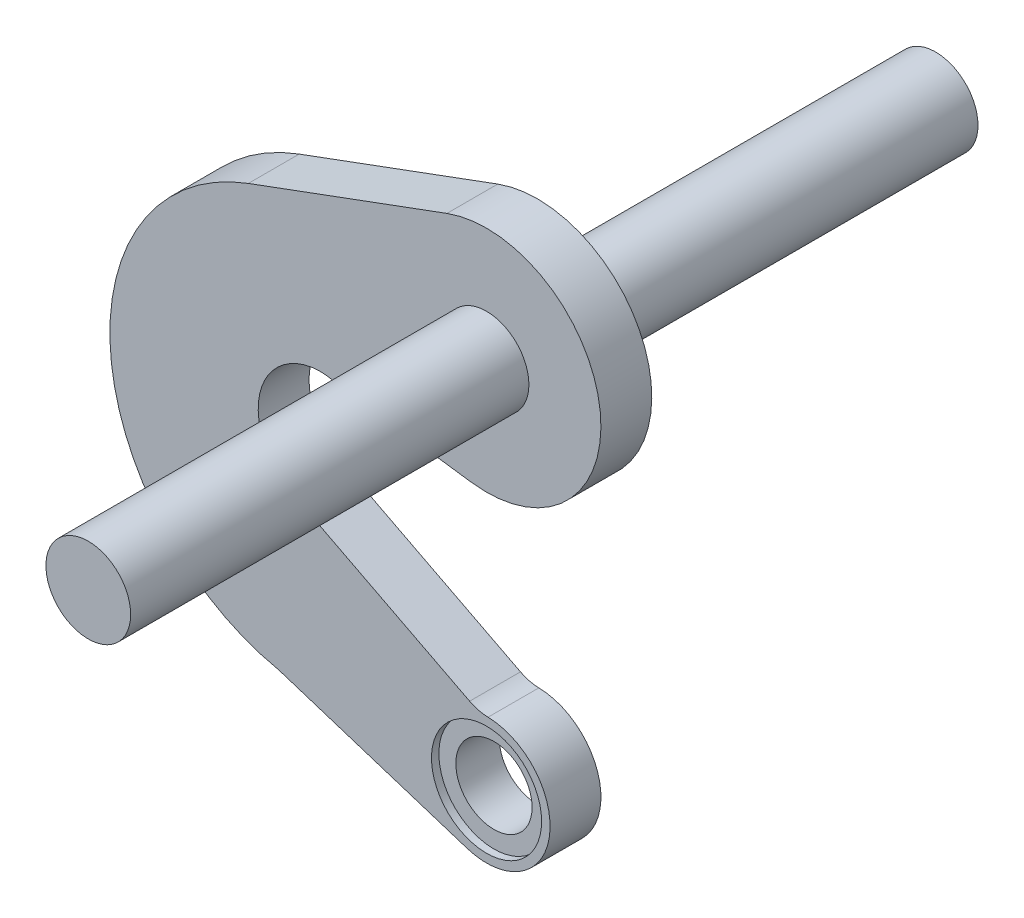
ISO-10303-21;
HEADER;
FILE_DESCRIPTION(('STEP AP214'),'2;1');
FILE_NAME('part.step','',(''),(''),'','','');
FILE_SCHEMA(('AUTOMOTIVE_DESIGN { 1 0 10303 214 1 1 1 1 }'));
ENDSEC;
DATA;
#1=APPLICATION_CONTEXT('core data for automotive mechanical design processes');
#2=APPLICATION_PROTOCOL_DEFINITION('international standard','automotive_design',2000,#1);
#3=PRODUCT_CONTEXT('',#1,'mechanical');
#4=PRODUCT('Part','Part','',(#3));
#5=PRODUCT_RELATED_PRODUCT_CATEGORY('part','',(#4));
#6=PRODUCT_DEFINITION_FORMATION('','',#4);
#7=PRODUCT_DEFINITION_CONTEXT('part definition',#1,'design');
#8=PRODUCT_DEFINITION('design','',#6,#7);
#9=PRODUCT_DEFINITION_SHAPE('','',#8);
#10=(LENGTH_UNIT() NAMED_UNIT(*) SI_UNIT(.MILLI.,.METRE.));
#11=(NAMED_UNIT(*) PLANE_ANGLE_UNIT() SI_UNIT($,.RADIAN.));
#12=(NAMED_UNIT(*) SI_UNIT($,.STERADIAN.) SOLID_ANGLE_UNIT());
#13=UNCERTAINTY_MEASURE_WITH_UNIT(LENGTH_MEASURE(1.E-05),#10,'distance_accuracy_value','');
#14=(GEOMETRIC_REPRESENTATION_CONTEXT(3) GLOBAL_UNCERTAINTY_ASSIGNED_CONTEXT((#13)) GLOBAL_UNIT_ASSIGNED_CONTEXT((#10,
#11,#12)) REPRESENTATION_CONTEXT('',''));
#15=CARTESIAN_POINT('',(0.,0.,0.));
#16=DIRECTION('',(0.,0.,1.));
#17=DIRECTION('',(1.,0.,0.));
#18=AXIS2_PLACEMENT_3D('',#15,#16,#17);
#19=CARTESIAN_POINT('',(0.,-87.8,-6.));
#20=DIRECTION('',(0.,0.,1.));
#21=DIRECTION('',(1.,0.,0.));
#22=AXIS2_PLACEMENT_3D('',#19,#20,#21);
#23=CYLINDRICAL_SURFACE('',#22,15.);
#24=CARTESIAN_POINT('',(0.,-87.8,6.));
#25=DIRECTION('',(0.,0.,1.));
#26=DIRECTION('',(1.,0.,0.));
#27=AXIS2_PLACEMENT_3D('',#24,#25,#26);
#28=CIRCLE('',#27,15.);
#29=CARTESIAN_POINT('',(-4.57525038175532,-102.08520507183,6.));
#30=VERTEX_POINT('',#29);
#31=CARTESIAN_POINT('',(0.34996282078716,-72.8040830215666,6.));
#32=VERTEX_POINT('',#31);
#33=EDGE_CURVE('E189',#30,#32,#28,.T.);
#34=ORIENTED_EDGE('',*,*,#33,.F.);
#35=DIRECTION('',(0.,0.,1.));
#36=VECTOR('',#35,1.);
#37=CARTESIAN_POINT('',(-4.57525038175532,-102.08520507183,-52.7038542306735));
#38=LINE('',#37,#36);
#39=CARTESIAN_POINT('',(-4.57525038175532,-102.08520507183,-6.));
#40=VERTEX_POINT('',#39);
#41=EDGE_CURVE('E139',#40,#30,#38,.T.);
#42=ORIENTED_EDGE('',*,*,#41,.F.);
#43=CARTESIAN_POINT('',(0.,-87.8,-6.));
#44=DIRECTION('',(0.,0.,1.));
#45=DIRECTION('',(1.,0.,0.));
#46=AXIS2_PLACEMENT_3D('',#43,#44,#45);
#47=CIRCLE('',#46,15.);
#48=CARTESIAN_POINT('',(0.34996282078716,-72.8040830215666,-6.));
#49=VERTEX_POINT('',#48);
#50=EDGE_CURVE('E195',#40,#49,#47,.T.);
#51=ORIENTED_EDGE('',*,*,#50,.T.);
#52=DIRECTION('',(0.,0.,-1.));
#53=VECTOR('',#52,1.);
#54=CARTESIAN_POINT('',(0.34996282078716,-72.8040830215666,6.));
#55=LINE('',#54,#53);
#56=EDGE_CURVE('E177',#32,#49,#55,.T.);
#57=ORIENTED_EDGE('',*,*,#56,.F.);
#58=EDGE_LOOP('',(#34,#42,#51,#57));
#59=FACE_BOUND('',#58,.T.);
#60=ADVANCED_FACE('F37',(#59),#23,.T.);
#61=CARTESIAN_POINT('',(0.,0.,-6.));
#62=DIRECTION('',(0.,0.,1.));
#63=DIRECTION('',(1.,0.,0.));
#64=AXIS2_PLACEMENT_3D('',#61,#62,#63);
#65=CYLINDRICAL_SURFACE('',#64,27.);
#66=DIRECTION('',(0.,0.,-1.));
#67=VECTOR('',#66,1.);
#68=CARTESIAN_POINT('',(-9.35237988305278,25.328501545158,55.9599839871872));
#69=LINE('',#68,#67);
#70=CARTESIAN_POINT('',(-9.35237988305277,25.328501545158,6.));
#71=VERTEX_POINT('',#70);
#72=CARTESIAN_POINT('',(-9.35237988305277,25.328501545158,-6.));
#73=VERTEX_POINT('',#72);
#74=EDGE_CURVE('E56',#71,#73,#69,.T.);
#75=ORIENTED_EDGE('',*,*,#74,.F.);
#76=CARTESIAN_POINT('',(0.,0.,6.));
#77=DIRECTION('',(0.,0.,1.));
#78=DIRECTION('',(1.,0.,0.));
#79=AXIS2_PLACEMENT_3D('',#76,#77,#78);
#80=CIRCLE('',#79,27.);
#81=CARTESIAN_POINT('',(-3.70089995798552,-26.7451554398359,6.));
#82=VERTEX_POINT('',#81);
#83=EDGE_CURVE('E130',#82,#71,#80,.T.);
#84=ORIENTED_EDGE('',*,*,#83,.F.);
#85=DIRECTION('',(0.,0.,1.));
#86=VECTOR('',#85,1.);
#87=CARTESIAN_POINT('',(-3.70089995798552,-26.7451554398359,-52.7038542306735));
#88=LINE('',#87,#86);
#89=CARTESIAN_POINT('',(-3.70089995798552,-26.7451554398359,-6.));
#90=VERTEX_POINT('',#89);
#91=EDGE_CURVE('E151',#90,#82,#88,.T.);
#92=ORIENTED_EDGE('',*,*,#91,.F.);
#93=CARTESIAN_POINT('',(0.,0.,-6.));
#94=DIRECTION('',(0.,0.,1.));
#95=DIRECTION('',(1.,0.,0.));
#96=AXIS2_PLACEMENT_3D('',#93,#94,#95);
#97=CIRCLE('',#96,27.);
#98=EDGE_CURVE('E52',#90,#73,#97,.T.);
#99=ORIENTED_EDGE('',*,*,#98,.T.);
#100=EDGE_LOOP('',(#75,#84,#92,#99));
#101=FACE_BOUND('',#100,.T.);
#102=ADVANCED_FACE('F222',(#101),#65,.T.);
#103=CARTESIAN_POINT('',(0.,-87.8,-6.));
#104=DIRECTION('',(0.,0.,1.));
#105=DIRECTION('',(1.,0.,0.));
#106=AXIS2_PLACEMENT_3D('',#103,#104,#105);
#107=CYLINDRICAL_SURFACE('',#106,9.);
#108=CARTESIAN_POINT('',(0.,-87.8,-6.));
#109=DIRECTION('',(0.,0.,1.));
#110=DIRECTION('',(1.,0.,0.));
#111=AXIS2_PLACEMENT_3D('',#108,#109,#110);
#112=CIRCLE('',#111,9.);
#113=CARTESIAN_POINT('',(9.,-87.8,-6.));
#114=VERTEX_POINT('',#113);
#115=EDGE_CURVE('E192',#114,#114,#112,.T.);
#116=ORIENTED_EDGE('',*,*,#115,.F.);
#117=EDGE_LOOP('',(#116));
#118=FACE_BOUND('',#117,.T.);
#119=CARTESIAN_POINT('',(0.,-87.8,4.25));
#120=DIRECTION('',(0.,0.,1.));
#121=DIRECTION('',(1.,0.,0.));
#122=AXIS2_PLACEMENT_3D('',#119,#120,#121);
#123=CIRCLE('',#122,9.);
#124=CARTESIAN_POINT('',(9.,-87.8,4.25));
#125=VERTEX_POINT('',#124);
#126=EDGE_CURVE('E158',#125,#125,#123,.F.);
#127=ORIENTED_EDGE('',*,*,#126,.F.);
#128=EDGE_LOOP('',(#127));
#129=FACE_BOUND('',#128,.T.);
#130=ADVANCED_FACE('F256',(#118,#129),#107,.F.);
#131=CARTESIAN_POINT('',(0.,-87.8,-6.));
#132=DIRECTION('',(0.,0.,1.));
#133=DIRECTION('',(1.,0.,0.));
#134=AXIS2_PLACEMENT_3D('',#131,#132,#133);
#135=PLANE('',#134);
#136=DIRECTION('',(0.938092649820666,0.346384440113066,0.));
#137=VECTOR('',#136,1.);
#138=CARTESIAN_POINT('',(-9.35237988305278,25.328501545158,-6.));
#139=LINE('',#138,#137);
#140=CARTESIAN_POINT('',(-56.2194736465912,8.02314046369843,-6.));
#141=VERTEX_POINT('',#140);
#142=EDGE_CURVE('E132',#141,#73,#139,.T.);
#143=ORIENTED_EDGE('',*,*,#142,.T.);
#144=ORIENTED_EDGE('',*,*,#98,.F.);
#145=DIRECTION('',(-0.990561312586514,0.137070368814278,0.));
#146=VECTOR('',#145,1.);
#147=CARTESIAN_POINT('',(-3.70089995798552,-26.7451554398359,-6.));
#148=LINE('',#147,#146);
#149=CARTESIAN_POINT('',(-37.7392676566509,-22.0350465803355,-6.));
#150=VERTEX_POINT('',#149);
#151=EDGE_CURVE('E147',#90,#150,#148,.T.);
#152=ORIENTED_EDGE('',*,*,#151,.T.);
#153=CARTESIAN_POINT('',(-39.3841120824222,-33.9217823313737,-6.));
#154=DIRECTION('',(0.,0.,1.));
#155=DIRECTION('',(1.,0.,0.));
#156=AXIS2_PLACEMENT_3D('',#153,#154,#155);
#157=CIRCLE('',#156,12.);
#158=CARTESIAN_POINT('',(-41.3439627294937,-22.0829063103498,-6.));
#159=VERTEX_POINT('',#158);
#160=EDGE_CURVE('E45',#150,#159,#157,.T.);
#161=ORIENTED_EDGE('',*,*,#160,.T.);
#162=CARTESIAN_POINT('',(-38.8941494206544,-36.8815013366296,-6.));
#163=DIRECTION('',(0.,0.,1.));
#164=DIRECTION('',(1.,0.,0.));
#165=AXIS2_PLACEMENT_3D('',#162,#163,#164);
#166=CIRCLE('',#165,15.);
#167=CARTESIAN_POINT('',(-45.754408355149,-50.2207984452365,-6.));
#168=VERTEX_POINT('',#167);
#169=EDGE_CURVE('E170',#159,#168,#166,.T.);
#170=ORIENTED_EDGE('',*,*,#169,.T.);
#171=DIRECTION('',(0.889286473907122,-0.457350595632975,0.));
#172=VECTOR('',#171,1.);
#173=CARTESIAN_POINT('',(-3.99023458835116,-71.6996697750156,-6.));
#174=LINE('',#173,#172);
#175=CARTESIAN_POINT('',(-3.99023458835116,-71.6996697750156,-6.));
#176=VERTEX_POINT('',#175);
#177=EDGE_CURVE('E172',#168,#176,#174,.T.);
#178=ORIENTED_EDGE('',*,*,#177,.T.);
#179=CARTESIAN_POINT('',(0.583271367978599,-62.8068050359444,-6.));
#180=DIRECTION('',(0.,0.,1.));
#181=DIRECTION('',(-1.,0.,0.));
#182=AXIS2_PLACEMENT_3D('',#179,#180,#181);
#183=CIRCLE('',#182,10.);
#184=EDGE_CURVE('E124',#176,#49,#183,.T.);
#185=ORIENTED_EDGE('',*,*,#184,.T.);
#186=ORIENTED_EDGE('',*,*,#50,.F.);
#187=DIRECTION('',(-0.952347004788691,0.305016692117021,0.));
#188=VECTOR('',#187,1.);
#189=CARTESIAN_POINT('',(-4.57525038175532,-102.08520507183,-6.));
#190=LINE('',#189,#188);
#191=CARTESIAN_POINT('',(-49.0535260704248,-87.8397499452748,-6.));
#192=VERTEX_POINT('',#191);
#193=EDGE_CURVE('E143',#40,#192,#190,.T.);
#194=ORIENTED_EDGE('',*,*,#193,.T.);
#195=CARTESIAN_POINT('',(-38.900251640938,-38.8814920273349,-6.));
#196=DIRECTION('',(0.,0.,-1.));
#197=DIRECTION('',(-1.,0.,0.));
#198=AXIS2_PLACEMENT_3D('',#195,#196,#197);
#199=CIRCLE('',#198,50.);
#200=EDGE_CURVE('E168',#192,#141,#199,.T.);
#201=ORIENTED_EDGE('',*,*,#200,.T.);
#202=EDGE_LOOP('',(#143,#144,#152,#161,#170,#178,#185,#186,#194,#201));
#203=FACE_BOUND('',#202,.T.);
#204=CARTESIAN_POINT('',(0.,0.,-6.00000000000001));
#205=DIRECTION('',(0.,0.,1.));
#206=DIRECTION('',(1.,0.,0.));
#207=AXIS2_PLACEMENT_3D('',#204,#205,#206);
#208=CIRCLE('',#207,10.);
#209=CARTESIAN_POINT('',(10.,0.,-6.00000000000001));
#210=VERTEX_POINT('',#209);
#211=EDGE_CURVE('E223',#210,#210,#208,.T.);
#212=ORIENTED_EDGE('',*,*,#211,.T.);
#213=EDGE_LOOP('',(#212));
#214=FACE_BOUND('',#213,.T.);
#215=ORIENTED_EDGE('',*,*,#115,.T.);
#216=EDGE_LOOP('',(#215));
#217=FACE_BOUND('',#216,.T.);
#218=ADVANCED_FACE('F206',(#203,#214,#217),#135,.F.);
#219=CARTESIAN_POINT('',(0.,-87.8,6.));
#220=DIRECTION('',(0.,0.,1.));
#221=DIRECTION('',(1.,0.,0.));
#222=AXIS2_PLACEMENT_3D('',#219,#220,#221);
#223=PLANE('',#222);
#224=ORIENTED_EDGE('',*,*,#83,.T.);
#225=DIRECTION('',(0.938092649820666,0.346384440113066,0.));
#226=VECTOR('',#225,1.);
#227=CARTESIAN_POINT('',(-9.35237988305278,25.328501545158,6.));
#228=LINE('',#227,#226);
#229=CARTESIAN_POINT('',(-56.2194736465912,8.02314046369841,6.));
#230=VERTEX_POINT('',#229);
#231=EDGE_CURVE('E127',#230,#71,#228,.T.);
#232=ORIENTED_EDGE('',*,*,#231,.F.);
#233=CARTESIAN_POINT('',(-38.900251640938,-38.8814920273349,6.));
#234=DIRECTION('',(0.,0.,-1.));
#235=DIRECTION('',(-1.,0.,0.));
#236=AXIS2_PLACEMENT_3D('',#233,#234,#235);
#237=CIRCLE('',#236,50.);
#238=CARTESIAN_POINT('',(-49.0535260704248,-87.8397499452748,6.));
#239=VERTEX_POINT('',#238);
#240=EDGE_CURVE('E112',#239,#230,#237,.T.);
#241=ORIENTED_EDGE('',*,*,#240,.F.);
#242=DIRECTION('',(0.952347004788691,-0.305016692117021,0.));
#243=VECTOR('',#242,1.);
#244=CARTESIAN_POINT('',(-4.57525038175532,-102.08520507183,6.));
#245=LINE('',#244,#243);
#246=EDGE_CURVE('E137',#239,#30,#245,.T.);
#247=ORIENTED_EDGE('',*,*,#246,.T.);
#248=ORIENTED_EDGE('',*,*,#33,.T.);
#249=CARTESIAN_POINT('',(0.583271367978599,-62.8068050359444,6.));
#250=DIRECTION('',(0.,0.,1.));
#251=DIRECTION('',(-1.,0.,0.));
#252=AXIS2_PLACEMENT_3D('',#249,#250,#251);
#253=CIRCLE('',#252,10.);
#254=CARTESIAN_POINT('',(-3.99023458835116,-71.6996697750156,6.));
#255=VERTEX_POINT('',#254);
#256=EDGE_CURVE('E165',#255,#32,#253,.T.);
#257=ORIENTED_EDGE('',*,*,#256,.F.);
#258=DIRECTION('',(0.889286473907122,-0.457350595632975,0.));
#259=VECTOR('',#258,1.);
#260=CARTESIAN_POINT('',(-3.99023458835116,-71.6996697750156,6.));
#261=LINE('',#260,#259);
#262=CARTESIAN_POINT('',(-45.754408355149,-50.2207984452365,6.));
#263=VERTEX_POINT('',#262);
#264=EDGE_CURVE('E162',#263,#255,#261,.T.);
#265=ORIENTED_EDGE('',*,*,#264,.F.);
#266=CARTESIAN_POINT('',(-38.8941494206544,-36.8815013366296,6.));
#267=DIRECTION('',(0.,0.,1.));
#268=DIRECTION('',(1.,0.,0.));
#269=AXIS2_PLACEMENT_3D('',#266,#267,#268);
#270=CIRCLE('',#269,15.);
#271=CARTESIAN_POINT('',(-41.3439627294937,-22.0829063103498,6.));
#272=VERTEX_POINT('',#271);
#273=EDGE_CURVE('E123',#272,#263,#270,.T.);
#274=ORIENTED_EDGE('',*,*,#273,.F.);
#275=CARTESIAN_POINT('',(-39.3841120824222,-33.9217823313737,6.));
#276=DIRECTION('',(0.,0.,1.));
#277=DIRECTION('',(1.,0.,0.));
#278=AXIS2_PLACEMENT_3D('',#275,#276,#277);
#279=CIRCLE('',#278,12.);
#280=CARTESIAN_POINT('',(-37.7392676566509,-22.0350465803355,6.));
#281=VERTEX_POINT('',#280);
#282=EDGE_CURVE('E12',#272,#281,#279,.F.);
#283=ORIENTED_EDGE('',*,*,#282,.T.);
#284=DIRECTION('',(0.990561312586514,-0.137070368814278,0.));
#285=VECTOR('',#284,1.);
#286=CARTESIAN_POINT('',(-3.70089995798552,-26.7451554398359,6.));
#287=LINE('',#286,#285);
#288=EDGE_CURVE('E144',#281,#82,#287,.T.);
#289=ORIENTED_EDGE('',*,*,#288,.T.);
#290=EDGE_LOOP('',(#224,#232,#241,#247,#248,#257,#265,#274,#283,#289));
#291=FACE_BOUND('',#290,.T.);
#292=CARTESIAN_POINT('',(0.,-87.8,6.));
#293=DIRECTION('',(0.,0.,1.));
#294=DIRECTION('',(1.,0.,0.));
#295=AXIS2_PLACEMENT_3D('',#292,#293,#294);
#296=CIRCLE('',#295,13.);
#297=CARTESIAN_POINT('',(13.,-87.8,6.));
#298=VERTEX_POINT('',#297);
#299=EDGE_CURVE('E150',#298,#298,#296,.T.);
#300=ORIENTED_EDGE('',*,*,#299,.F.);
#301=EDGE_LOOP('',(#300));
#302=FACE_BOUND('',#301,.T.);
#303=CARTESIAN_POINT('',(0.,0.,6.));
#304=DIRECTION('',(0.,0.,1.));
#305=DIRECTION('',(1.,0.,0.));
#306=AXIS2_PLACEMENT_3D('',#303,#304,#305);
#307=CIRCLE('',#306,10.);
#308=CARTESIAN_POINT('',(10.,0.,6.));
#309=VERTEX_POINT('',#308);
#310=EDGE_CURVE('E180',#309,#309,#307,.T.);
#311=ORIENTED_EDGE('',*,*,#310,.F.);
#312=EDGE_LOOP('',(#311));
#313=FACE_BOUND('',#312,.T.);
#314=ADVANCED_FACE('F128',(#291,#302,#313),#223,.T.);
#315=CARTESIAN_POINT('',(-38.8941494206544,-36.8815013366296,6.));
#316=DIRECTION('',(0.,0.,-1.));
#317=DIRECTION('',(-1.,0.,0.));
#318=AXIS2_PLACEMENT_3D('',#315,#316,#317);
#319=CYLINDRICAL_SURFACE('',#318,15.);
#320=ORIENTED_EDGE('',*,*,#169,.F.);
#321=DIRECTION('',(0.,0.,-1.));
#322=VECTOR('',#321,1.);
#323=CARTESIAN_POINT('',(-41.3439627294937,-22.0829063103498,6.));
#324=LINE('',#323,#322);
#325=EDGE_CURVE('E203',#159,#272,#324,.F.);
#326=ORIENTED_EDGE('',*,*,#325,.T.);
#327=ORIENTED_EDGE('',*,*,#273,.T.);
#328=DIRECTION('',(0.,0.,-1.));
#329=VECTOR('',#328,1.);
#330=CARTESIAN_POINT('',(-45.754408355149,-50.2207984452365,6.));
#331=LINE('',#330,#329);
#332=EDGE_CURVE('E183',#263,#168,#331,.T.);
#333=ORIENTED_EDGE('',*,*,#332,.T.);
#334=EDGE_LOOP('',(#320,#326,#327,#333));
#335=FACE_BOUND('',#334,.T.);
#336=ADVANCED_FACE('F213',(#335),#319,.F.);
#337=CARTESIAN_POINT('',(-3.99023458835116,-71.6996697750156,6.));
#338=DIRECTION('',(0.457350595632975,0.889286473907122,0.));
#339=DIRECTION('',(-0.889286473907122,0.457350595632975,0.));
#340=AXIS2_PLACEMENT_3D('',#337,#338,#339);
#341=PLANE('',#340);
#342=ORIENTED_EDGE('',*,*,#177,.F.);
#343=ORIENTED_EDGE('',*,*,#332,.F.);
#344=ORIENTED_EDGE('',*,*,#264,.T.);
#345=DIRECTION('',(0.,0.,-1.));
#346=VECTOR('',#345,1.);
#347=CARTESIAN_POINT('',(-3.99023458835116,-71.6996697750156,6.));
#348=LINE('',#347,#346);
#349=EDGE_CURVE('E181',#255,#176,#348,.T.);
#350=ORIENTED_EDGE('',*,*,#349,.T.);
#351=EDGE_LOOP('',(#342,#343,#344,#350));
#352=FACE_BOUND('',#351,.T.);
#353=ADVANCED_FACE('F273',(#352),#341,.T.);
#354=CARTESIAN_POINT('',(0.583271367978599,-62.8068050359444,6.));
#355=DIRECTION('',(0.,0.,-1.));
#356=DIRECTION('',(-1.,0.,0.));
#357=AXIS2_PLACEMENT_3D('',#354,#355,#356);
#358=CYLINDRICAL_SURFACE('',#357,10.);
#359=ORIENTED_EDGE('',*,*,#184,.F.);
#360=ORIENTED_EDGE('',*,*,#349,.F.);
#361=ORIENTED_EDGE('',*,*,#256,.T.);
#362=ORIENTED_EDGE('',*,*,#56,.T.);
#363=EDGE_LOOP('',(#359,#360,#361,#362));
#364=FACE_BOUND('',#363,.T.);
#365=ADVANCED_FACE('F270',(#364),#358,.F.);
#366=CARTESIAN_POINT('',(-38.900251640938,-38.8814920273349,6.));
#367=DIRECTION('',(0.,0.,-1.));
#368=DIRECTION('',(-1.,0.,0.));
#369=AXIS2_PLACEMENT_3D('',#366,#367,#368);
#370=CYLINDRICAL_SURFACE('',#369,50.);
#371=DIRECTION('',(0.,0.,-1.));
#372=VECTOR('',#371,1.);
#373=CARTESIAN_POINT('',(-56.2194736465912,8.0231404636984,55.9599839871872));
#374=LINE('',#373,#372);
#375=EDGE_CURVE('E117',#230,#141,#374,.T.);
#376=ORIENTED_EDGE('',*,*,#375,.T.);
#377=ORIENTED_EDGE('',*,*,#200,.F.);
#378=DIRECTION('',(0.,0.,-1.));
#379=VECTOR('',#378,1.);
#380=CARTESIAN_POINT('',(-49.0535260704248,-87.8397499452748,6.));
#381=LINE('',#380,#379);
#382=EDGE_CURVE('E120',#239,#192,#381,.T.);
#383=ORIENTED_EDGE('',*,*,#382,.F.);
#384=ORIENTED_EDGE('',*,*,#240,.T.);
#385=EDGE_LOOP('',(#376,#377,#383,#384));
#386=FACE_BOUND('',#385,.T.);
#387=ADVANCED_FACE('F114',(#386),#370,.T.);
#388=CARTESIAN_POINT('',(0.,-87.8,4.25));
#389=DIRECTION('',(0.,0.,1.));
#390=DIRECTION('',(1.,0.,0.));
#391=AXIS2_PLACEMENT_3D('',#388,#389,#390);
#392=PLANE('',#391);
#393=CARTESIAN_POINT('',(0.,-87.8,4.25));
#394=DIRECTION('',(0.,0.,1.));
#395=DIRECTION('',(1.,0.,0.));
#396=AXIS2_PLACEMENT_3D('',#393,#394,#395);
#397=CIRCLE('',#396,13.);
#398=CARTESIAN_POINT('',(13.,-87.8,4.25));
#399=VERTEX_POINT('',#398);
#400=EDGE_CURVE('E155',#399,#399,#397,.T.);
#401=ORIENTED_EDGE('',*,*,#400,.T.);
#402=EDGE_LOOP('',(#401));
#403=FACE_BOUND('',#402,.T.);
#404=ORIENTED_EDGE('',*,*,#126,.T.);
#405=EDGE_LOOP('',(#404));
#406=FACE_BOUND('',#405,.T.);
#407=ADVANCED_FACE('F269',(#403,#406),#392,.T.);
#408=CARTESIAN_POINT('',(0.,-87.8,4.25));
#409=DIRECTION('',(0.,0.,1.));
#410=DIRECTION('',(1.,0.,0.));
#411=AXIS2_PLACEMENT_3D('',#408,#409,#410);
#412=CYLINDRICAL_SURFACE('',#411,13.);
#413=ORIENTED_EDGE('',*,*,#400,.F.);
#414=EDGE_LOOP('',(#413));
#415=FACE_BOUND('',#414,.T.);
#416=ORIENTED_EDGE('',*,*,#299,.T.);
#417=EDGE_LOOP('',(#416));
#418=FACE_BOUND('',#417,.T.);
#419=ADVANCED_FACE('F280',(#415,#418),#412,.F.);
#420=CARTESIAN_POINT('',(-3.70089995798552,-26.7451554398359,-52.7038542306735));
#421=DIRECTION('',(-0.137070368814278,-0.990561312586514,0.));
#422=DIRECTION('',(0.990561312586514,-0.137070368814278,0.));
#423=AXIS2_PLACEMENT_3D('',#420,#421,#422);
#424=PLANE('',#423);
#425=ORIENTED_EDGE('',*,*,#288,.F.);
#426=DIRECTION('',(0.,0.,1.));
#427=VECTOR('',#426,1.);
#428=CARTESIAN_POINT('',(-37.7392676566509,-22.0350465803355,-6.));
#429=LINE('',#428,#427);
#430=EDGE_CURVE('E198',#281,#150,#429,.F.);
#431=ORIENTED_EDGE('',*,*,#430,.T.);
#432=ORIENTED_EDGE('',*,*,#151,.F.);
#433=ORIENTED_EDGE('',*,*,#91,.T.);
#434=EDGE_LOOP('',(#425,#431,#432,#433));
#435=FACE_BOUND('',#434,.T.);
#436=ADVANCED_FACE('F221',(#435),#424,.T.);
#437=CARTESIAN_POINT('',(-4.57525038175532,-102.08520507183,-52.7038542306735));
#438=DIRECTION('',(-0.305016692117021,-0.952347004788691,0.));
#439=DIRECTION('',(0.952347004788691,-0.305016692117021,0.));
#440=AXIS2_PLACEMENT_3D('',#437,#438,#439);
#441=PLANE('',#440);
#442=ORIENTED_EDGE('',*,*,#193,.F.);
#443=ORIENTED_EDGE('',*,*,#41,.T.);
#444=ORIENTED_EDGE('',*,*,#246,.F.);
#445=ORIENTED_EDGE('',*,*,#382,.T.);
#446=EDGE_LOOP('',(#442,#443,#444,#445));
#447=FACE_BOUND('',#446,.T.);
#448=ADVANCED_FACE('F289',(#447),#441,.T.);
#449=CARTESIAN_POINT('',(-39.3841120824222,-33.9217823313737,6.));
#450=DIRECTION('',(0.,0.,-1.));
#451=DIRECTION('',(-1.,0.,0.));
#452=AXIS2_PLACEMENT_3D('',#449,#450,#451);
#453=CYLINDRICAL_SURFACE('',#452,12.);
#454=ORIENTED_EDGE('',*,*,#282,.F.);
#455=ORIENTED_EDGE('',*,*,#325,.F.);
#456=ORIENTED_EDGE('',*,*,#160,.F.);
#457=ORIENTED_EDGE('',*,*,#430,.F.);
#458=EDGE_LOOP('',(#454,#455,#456,#457));
#459=FACE_BOUND('',#458,.T.);
#460=ADVANCED_FACE('F39',(#459),#453,.F.);
#461=CARTESIAN_POINT('',(-9.35237988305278,25.328501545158,55.9599839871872));
#462=DIRECTION('',(-0.346384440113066,0.938092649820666,0.));
#463=DIRECTION('',(-0.938092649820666,-0.346384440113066,0.));
#464=AXIS2_PLACEMENT_3D('',#461,#462,#463);
#465=PLANE('',#464);
#466=ORIENTED_EDGE('',*,*,#375,.F.);
#467=ORIENTED_EDGE('',*,*,#231,.T.);
#468=ORIENTED_EDGE('',*,*,#74,.T.);
#469=ORIENTED_EDGE('',*,*,#142,.F.);
#470=EDGE_LOOP('',(#466,#467,#468,#469));
#471=FACE_BOUND('',#470,.T.);
#472=ADVANCED_FACE('F135',(#471),#465,.T.);
#473=CARTESIAN_POINT('',(0.,0.,100.));
#474=DIRECTION('',(0.,0.,1.));
#475=DIRECTION('',(1.,0.,0.));
#476=AXIS2_PLACEMENT_3D('',#473,#474,#475);
#477=PLANE('',#476);
#478=CARTESIAN_POINT('',(0.,0.,100.));
#479=DIRECTION('',(0.,0.,1.));
#480=DIRECTION('',(1.,0.,0.));
#481=AXIS2_PLACEMENT_3D('',#478,#479,#480);
#482=CIRCLE('',#481,10.);
#483=CARTESIAN_POINT('',(10.,0.,100.));
#484=VERTEX_POINT('',#483);
#485=EDGE_CURVE('E231',#484,#484,#482,.T.);
#486=ORIENTED_EDGE('',*,*,#485,.T.);
#487=EDGE_LOOP('',(#486));
#488=FACE_BOUND('',#487,.T.);
#489=ADVANCED_FACE('F235',(#488),#477,.T.);
#490=CARTESIAN_POINT('',(0.,0.,-100.));
#491=DIRECTION('',(0.,0.,1.));
#492=DIRECTION('',(1.,0.,0.));
#493=AXIS2_PLACEMENT_3D('',#490,#491,#492);
#494=CYLINDRICAL_SURFACE('',#493,10.);
#495=ORIENTED_EDGE('',*,*,#310,.T.);
#496=EDGE_LOOP('',(#495));
#497=FACE_BOUND('',#496,.T.);
#498=ORIENTED_EDGE('',*,*,#485,.F.);
#499=EDGE_LOOP('',(#498));
#500=FACE_BOUND('',#499,.T.);
#501=ADVANCED_FACE('F237',(#497,#500),#494,.T.);
#502=CARTESIAN_POINT('',(0.,0.,-100.));
#503=DIRECTION('',(0.,0.,1.));
#504=DIRECTION('',(1.,0.,0.));
#505=AXIS2_PLACEMENT_3D('',#502,#503,#504);
#506=CIRCLE('',#505,10.);
#507=CARTESIAN_POINT('',(10.,0.,-100.));
#508=VERTEX_POINT('',#507);
#509=EDGE_CURVE('E226',#508,#508,#506,.T.);
#510=ORIENTED_EDGE('',*,*,#509,.T.);
#511=EDGE_LOOP('',(#510));
#512=FACE_BOUND('',#511,.T.);
#513=ORIENTED_EDGE('',*,*,#211,.F.);
#514=EDGE_LOOP('',(#513));
#515=FACE_BOUND('',#514,.T.);
#516=ADVANCED_FACE('F239',(#512,#515),#494,.T.);
#517=CARTESIAN_POINT('',(0.,0.,-100.));
#518=DIRECTION('',(0.,0.,1.));
#519=DIRECTION('',(1.,0.,0.));
#520=AXIS2_PLACEMENT_3D('',#517,#518,#519);
#521=PLANE('',#520);
#522=ORIENTED_EDGE('',*,*,#509,.F.);
#523=EDGE_LOOP('',(#522));
#524=FACE_BOUND('',#523,.T.);
#525=ADVANCED_FACE('F246',(#524),#521,.F.);
#526=CLOSED_SHELL('',(#60,#102,#130,#218,#314,#336,#353,#365,#387,#407,#419,#436,#448,#460,#472,
#489,#501,#516,#525));
#527=MANIFOLD_SOLID_BREP('B2',#526);
#528=ADVANCED_BREP_SHAPE_REPRESENTATION('',(#18,#527),#14);
#529=SHAPE_DEFINITION_REPRESENTATION(#9,#528);
ENDSEC;
END-ISO-10303-21;
